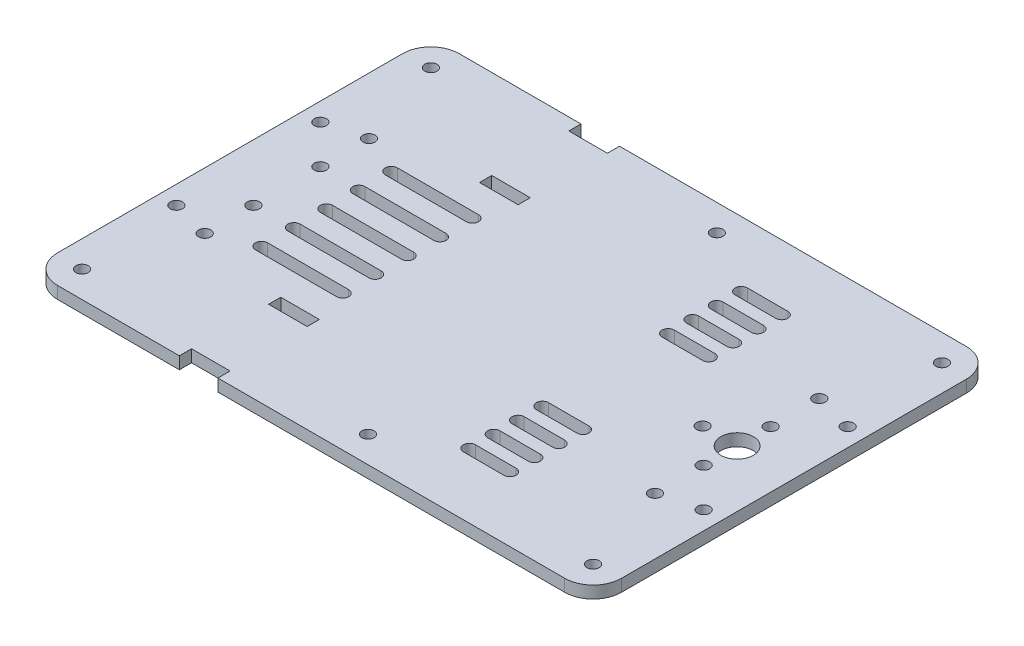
from build123d import *

# Parameters (mm, degrees)
SKETCH1_R           = 1.5
SKETCH1_W           = 9.5
SKETCH1_H           = 3
SKETCH1_R_2         = 4
BOSS_EXTRUDE1_DEPTH = 3


with BuildPart() as part:
    # Sketch1 → Boss-Extrude1 (new body)
    with BuildSketch(Plane(origin=(0, 0, 0), x_dir=(1, 0, 0), z_dir=(0, 1, 0))):
        with BuildLine():
            Line((-23, 46.5), (-32.5, 46.5))
            Line((-32.5, 46.5), (-32.5, 49.5))
            Line((-32.5, 49.5), (-62.5, 49.5))
            ThreePointArc((-62.5, 49.5), (-67.449747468, 47.449747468), (-69.5, 42.5))
            Line((-69.5, 42.5), (-69.5, -42.5))
            ThreePointArc((-69.5, -42.5), (-67.449747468, -47.449747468), (-62.5, -49.5))
            Line((-62.5, -49.5), (-32.5, -49.5))
            Line((-32.5, -49.5), (-32.5, -46.5))
            Line((-32.5, -46.5), (-23, -46.5))
            Line((-23, -46.5), (-23, -49.5))
            Line((-23, -49.5), (62.5, -49.5))
            ThreePointArc((62.5, -49.5), (67.449747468, -47.449747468), (69.5, -42.5))
            Line((69.5, -42.5), (69.5, 42.5))
            ThreePointArc((69.5, 42.5), (67.449747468, 47.449747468), (62.5, 49.5))
            Line((62.5, 49.5), (-23, 49.5))
            Line((-23, 49.5), (-23, 46.5))
        make_face()
        with Locations(Location((-63, -43, 0), (0, 0, 270))):
            Circle(SKETCH1_R, mode=Mode.SUBTRACT)
        with Locations((-27.75, -26)):
            Rectangle(SKETCH1_W, SKETCH1_H, mode=Mode.SUBTRACT)
        with Locations(Location((-55.5, -20.25, 0), (0, 0, 270))):
            Circle(SKETCH1_R, mode=Mode.SUBTRACT)
        with Locations(Location((-65, -17.75, 0), (0, 0, 270))):
            Circle(SKETCH1_R, mode=Mode.SUBTRACT)
        with BuildLine():
            Line((-25.75, -17.5), (-45.75, -17.5))
            ThreePointArc((-45.75, -17.5), (-47.25, -16), (-45.75, -14.5))
            Line((-45.75, -14.5), (-25.75, -14.5))
            ThreePointArc((-25.75, -14.5), (-24.25, -16), (-25.75, -17.5))
        make_face(mode=Mode.SUBTRACT)
        with Locations(Location((-55.5, -8.25, 0), (0, 0, 270))):
            Circle(SKETCH1_R, mode=Mode.SUBTRACT)
        with BuildLine():
            Line((-25.75, -9.5), (-45.75, -9.5))
            ThreePointArc((-45.75, -9.5), (-47.25, -8), (-45.75, -6.5))
            Line((-45.75, -6.5), (-25.75, -6.5))
            ThreePointArc((-25.75, -6.5), (-24.25, -8), (-25.75, -9.5))
        make_face(mode=Mode.SUBTRACT)
        with BuildLine():
            Line((-25.75, -1.5), (-45.75, -1.5))
            ThreePointArc((-45.75, -1.5), (-47.25, 0), (-45.75, 1.5))
            Line((-45.75, 1.5), (-25.75, 1.5))
            ThreePointArc((-25.75, 1.5), (-24.25, 0), (-25.75, -1.5))
        make_face(mode=Mode.SUBTRACT)
        with Locations(Location((7.5, -43, 0), (0, 0, 270))):
            Circle(SKETCH1_R, mode=Mode.SUBTRACT)
        with BuildLine():
            Line((23, -32), (33, -32))
            ThreePointArc((33, -32), (34.5, -33.5), (33, -35))
            Line((33, -35), (23, -35))
            ThreePointArc((23, -35), (21.5, -33.5), (23, -32))
        make_face(mode=Mode.SUBTRACT)
        with BuildLine():
            Line((23, -26), (33, -26))
            ThreePointArc((33, -26), (34.5, -27.5), (33, -29))
            Line((33, -29), (23, -29))
            ThreePointArc((23, -29), (21.5, -27.5), (23, -26))
        make_face(mode=Mode.SUBTRACT)
        with Locations(Location((63, -43, 0), (0, 0, 270))):
            Circle(SKETCH1_R, mode=Mode.SUBTRACT)
        with BuildLine():
            Line((23, -20), (33, -20))
            ThreePointArc((33, -20), (34.5, -21.5), (33, -23))
            Line((33, -23), (23, -23))
            ThreePointArc((23, -23), (21.5, -21.5), (23, -20))
        make_face(mode=Mode.SUBTRACT)
        with BuildLine():
            Line((23, -14), (33, -14))
            ThreePointArc((33, -14), (34.5, -15.5), (33, -17))
            Line((33, -17), (23, -17))
            ThreePointArc((23, -17), (21.5, -15.5), (23, -14))
        make_face(mode=Mode.SUBTRACT)
        with Locations(Location((55.5, -20.25, 0), (0, 0, 270))):
            Circle(SKETCH1_R, mode=Mode.SUBTRACT)
        with Locations(Location((65, -17.75, 0), (0, 0, 270))):
            Circle(SKETCH1_R, mode=Mode.SUBTRACT)
        with Locations(Location((55.5, -8.25, 0), (0, 0, 270))):
            Circle(SKETCH1_R, mode=Mode.SUBTRACT)
        with Locations(Location((-55.5, 8.25, 0), (0, 0, 270))):
            Circle(SKETCH1_R, mode=Mode.SUBTRACT)
        with BuildLine():
            Line((-25.75, 6.5), (-45.75, 6.5))
            ThreePointArc((-45.75, 6.5), (-47.25, 8), (-45.75, 9.5))
            Line((-45.75, 9.5), (-25.75, 9.5))
            ThreePointArc((-25.75, 9.5), (-24.25, 8), (-25.75, 6.5))
        make_face(mode=Mode.SUBTRACT)
        with Locations(Location((-65, 17.75, 0), (0, 0, 270))):
            Circle(SKETCH1_R, mode=Mode.SUBTRACT)
        with Locations(Location((-55.5, 20.25, 0), (0, 0, 270))):
            Circle(SKETCH1_R, mode=Mode.SUBTRACT)
        with BuildLine():
            ThreePointArc((-45.75, 14.5), (-47.25, 16), (-45.75, 17.5))
            Line((-45.75, 17.5), (-25.75, 17.5))
            ThreePointArc((-25.75, 17.5), (-24.25, 16), (-25.75, 14.5))
            Line((-25.75, 14.5), (-45.75, 14.5))
        make_face(mode=Mode.SUBTRACT)
        with Locations(Location((-63, 43, 0), (0, 0, 270))):
            Circle(SKETCH1_R, mode=Mode.SUBTRACT)
        with Locations((-27.75, 26)):
            Rectangle(SKETCH1_W, SKETCH1_H, mode=Mode.SUBTRACT)
        with BuildLine():
            ThreePointArc((33, 17), (34.5, 15.5), (33, 14))
            Line((33, 14), (23, 14))
            ThreePointArc((23, 14), (21.5, 15.5), (23, 17))
            Line((23, 17), (33, 17))
        make_face(mode=Mode.SUBTRACT)
        with BuildLine():
            Line((23, 23), (33, 23))
            ThreePointArc((33, 23), (34.5, 21.5), (33, 20))
            Line((33, 20), (23, 20))
            ThreePointArc((23, 20), (21.5, 21.5), (23, 23))
        make_face(mode=Mode.SUBTRACT)
        with Locations(Location((47, 0, 0), (0, 0, 270))):
            Circle(SKETCH1_R, mode=Mode.SUBTRACT)
        with Locations(Location((55.5, 0, 0), (0, 0, 270))):
            Circle(SKETCH1_R_2, mode=Mode.SUBTRACT)
        with Locations(Location((55.5, 8.25, 0), (0, 0, 270))):
            Circle(SKETCH1_R, mode=Mode.SUBTRACT)
        with Locations(Location((65, 17.75, 0), (0, 0, 270))):
            Circle(SKETCH1_R, mode=Mode.SUBTRACT)
        with Locations(Location((55.5, 20.25, 0), (0, 0, 270))):
            Circle(SKETCH1_R, mode=Mode.SUBTRACT)
        with BuildLine():
            Line((23, 29), (33, 29))
            ThreePointArc((33, 29), (34.5, 27.5), (33, 26))
            Line((33, 26), (23, 26))
            ThreePointArc((23, 26), (21.5, 27.5), (23, 29))
        make_face(mode=Mode.SUBTRACT)
        with BuildLine():
            Line((23, 35), (33, 35))
            ThreePointArc((33, 35), (34.5, 33.5), (33, 32))
            Line((33, 32), (23, 32))
            ThreePointArc((23, 32), (21.5, 33.5), (23, 35))
        make_face(mode=Mode.SUBTRACT)
        with Locations(Location((7.5, 43, 0), (0, 0, 270))):
            Circle(SKETCH1_R, mode=Mode.SUBTRACT)
        with Locations(Location((63, 43, 0), (0, 0, 270))):
            Circle(SKETCH1_R, mode=Mode.SUBTRACT)
    extrude(amount=BOSS_EXTRUDE1_DEPTH)


solid = part.part
